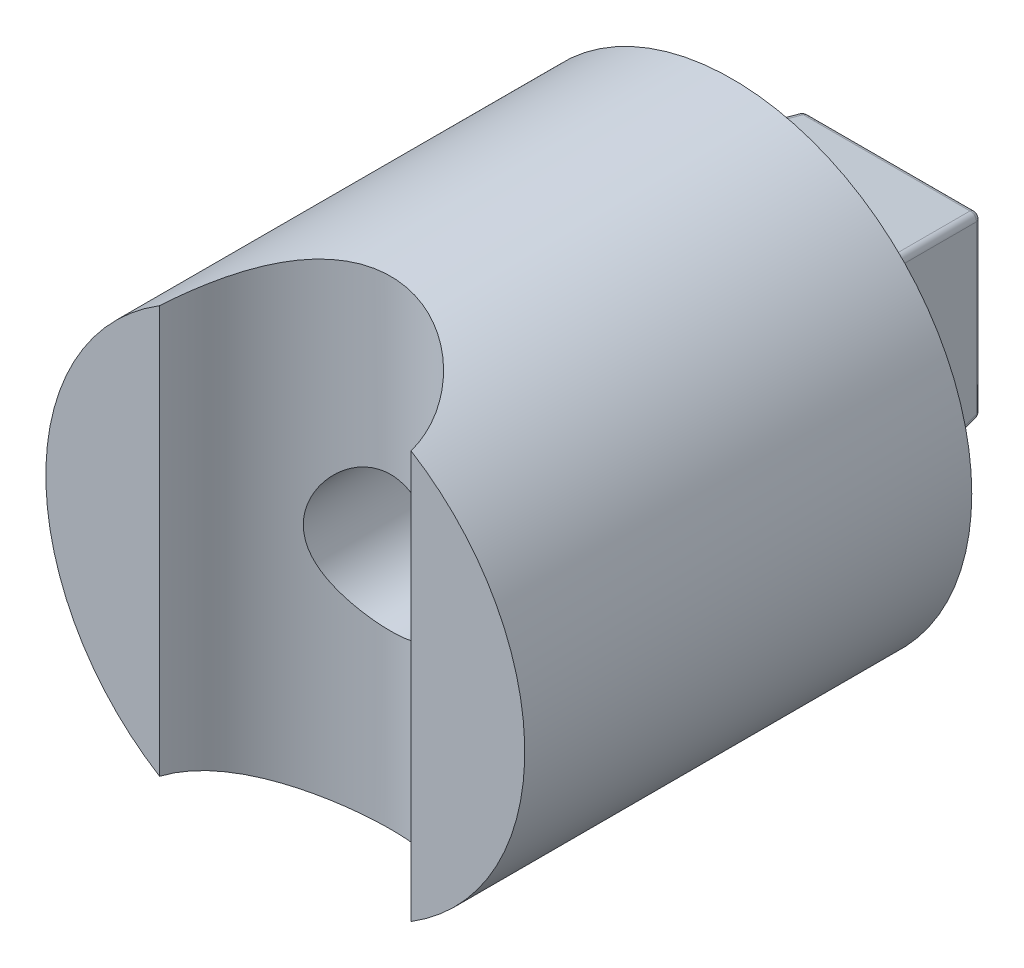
from build123d import *

# Parameters (mm, degrees)
ESQUISSE1_R                         = 15
EXTRUSION1_DEPTH                    = 28
ESQUISSE2_W                         = 14.3
ESQUISSE2_H                         = 14.3
EXTRUSION2_DEPTH                    = 10
EXTRUSION2_TAPER                    = 9
ESQUISSE3_R                         = 4.25
ENL_V_MAT_EXTRU_1_DEPTH             = 44.520110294
CONG_1_R                            = 0.4
ENL_V_MAT_EXTRU_2_REACH             = 37.128
ESQUISSE4_R                         = 8
ENL_V_MAT_EXTRU_2_DIRECTION_2_REACH = 37.128


with BuildPart() as part:
    # Esquisse1 → Extrusion1 (new body)
    with BuildSketch(Plane.XY):
        with Locations(Location((0, 0, 0), (0, 0, 238.324811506))):
            Circle(ESQUISSE1_R)
    extrude(amount=EXTRUSION1_DEPTH)

    # Esquisse2 → Extrusion2 (add)
    with BuildSketch(Plane(origin=(0, 0, 0), x_dir=(-1, 0, 0), z_dir=(0, 0, -1))):
        Rectangle(ESQUISSE2_W, ESQUISSE2_H)
    extrude(amount=EXTRUSION2_DEPTH, taper=EXTRUSION2_TAPER)

    # Esquisse3 → Enl_v. mat.-Extru.1 (cut, through all)
    with BuildSketch(Plane(origin=(0, 0, -10), x_dir=(-1, 0, 0), z_dir=(0, 0, -1))):
        Circle(ESQUISSE3_R)
    extrude(amount=-ENL_V_MAT_EXTRU_1_DEPTH, mode=Mode.SUBTRACT)

    # Cong_1
    cong_1_edges = [part.edges().sort_by_distance(p)[0] for p in [
        (0, 7.15, 0),
        (-7.15, 0, 0),
        (0, -7.15, 0),
        (7.15, 0, 0),
        (6.358077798, 6.358077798, -5),
        (0, 5.566155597, -10),
        (-6.358077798, 6.358077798, -5),
        (-5.566155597, 0, -10),
        (-6.358077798, -6.358077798, -5),
        (0, -5.566155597, -10),
        (6.358077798, -6.358077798, -5),
        (5.566155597, 0, -10),
    ]]
    fillet(cong_1_edges, radius=CONG_1_R)

    # Esquisse4 → Enl_v. mat.-Extru.2 (cut, up to next)
    with BuildSketch(Plane(origin=(0, 0, 0), x_dir=(1, 0, 0), z_dir=(0, 1, 0)), mode=Mode.PRIVATE) as enl_v_mat_extru_2_sk1:
        with Locations((0, -29.4)):
            Circle(ESQUISSE4_R)
    enl_v_mat_extru_2_tool1 = extrude(enl_v_mat_extru_2_sk1.sketch, amount=-ENL_V_MAT_EXTRU_2_REACH, mode=Mode.PRIVATE) & part.part
    add(enl_v_mat_extru_2_tool1.solids().sort_by_distance((0, 0, 29.4))[0], mode=Mode.SUBTRACT)

    # Esquisse4 → Enl_v. mat.-Extru.2 direction 2 (cut, up to next)
    with BuildSketch(Plane(origin=(0, 0, 0), x_dir=(1, 0, 0), z_dir=(0, 1, 0)), mode=Mode.PRIVATE) as enl_v_mat_extru_2_direction_2_sk1:
        with Locations((0, -29.4)):
            Circle(ESQUISSE4_R)
    enl_v_mat_extru_2_direction_2_tool1 = extrude(enl_v_mat_extru_2_direction_2_sk1.sketch, amount=ENL_V_MAT_EXTRU_2_DIRECTION_2_REACH, mode=Mode.PRIVATE) & part.part
    add(enl_v_mat_extru_2_direction_2_tool1.solids().sort_by_distance((0, 0, 29.4))[0], mode=Mode.SUBTRACT)


solid = part.part
